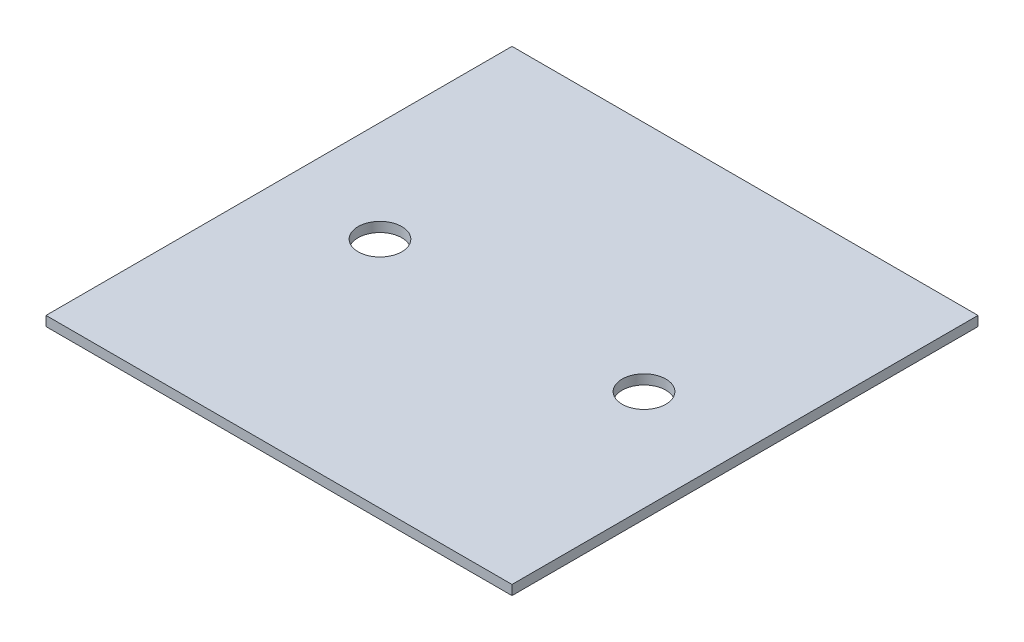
ISO-10303-21;
HEADER;
FILE_DESCRIPTION(('STEP AP214'),'2;1');
FILE_NAME('part.step','',(''),(''),'','','');
FILE_SCHEMA(('AUTOMOTIVE_DESIGN { 1 0 10303 214 1 1 1 1 }'));
ENDSEC;
DATA;
#1=APPLICATION_CONTEXT('core data for automotive mechanical design processes');
#2=APPLICATION_PROTOCOL_DEFINITION('international standard','automotive_design',2000,#1);
#3=PRODUCT_CONTEXT('',#1,'mechanical');
#4=PRODUCT('Part','Part','',(#3));
#5=PRODUCT_RELATED_PRODUCT_CATEGORY('part','',(#4));
#6=PRODUCT_DEFINITION_FORMATION('','',#4);
#7=PRODUCT_DEFINITION_CONTEXT('part definition',#1,'design');
#8=PRODUCT_DEFINITION('design','',#6,#7);
#9=PRODUCT_DEFINITION_SHAPE('','',#8);
#10=(LENGTH_UNIT() NAMED_UNIT(*) SI_UNIT(.MILLI.,.METRE.));
#11=(NAMED_UNIT(*) PLANE_ANGLE_UNIT() SI_UNIT($,.RADIAN.));
#12=(NAMED_UNIT(*) SI_UNIT($,.STERADIAN.) SOLID_ANGLE_UNIT());
#13=UNCERTAINTY_MEASURE_WITH_UNIT(LENGTH_MEASURE(1.E-05),#10,'distance_accuracy_value','');
#14=(GEOMETRIC_REPRESENTATION_CONTEXT(3) GLOBAL_UNCERTAINTY_ASSIGNED_CONTEXT((#13)) GLOBAL_UNIT_ASSIGNED_CONTEXT((#10,
#11,#12)) REPRESENTATION_CONTEXT('',''));
#15=CARTESIAN_POINT('',(0.,0.,0.));
#16=DIRECTION('',(0.,0.,1.));
#17=DIRECTION('',(1.,0.,0.));
#18=AXIS2_PLACEMENT_3D('',#15,#16,#17);
#19=CARTESIAN_POINT('',(-76.2,3.175,-76.2));
#20=DIRECTION('',(1.,0.,0.));
#21=DIRECTION('',(0.,0.,-1.));
#22=AXIS2_PLACEMENT_3D('',#19,#20,#21);
#23=PLANE('',#22);
#24=DIRECTION('',(0.,0.,1.));
#25=VECTOR('',#24,1.);
#26=CARTESIAN_POINT('',(-76.2,0.,-76.2));
#27=LINE('',#26,#25);
#28=CARTESIAN_POINT('',(-76.2,0.,-76.2));
#29=VERTEX_POINT('',#28);
#30=CARTESIAN_POINT('',(-76.2,0.,76.2));
#31=VERTEX_POINT('',#30);
#32=EDGE_CURVE('E96',#29,#31,#27,.T.);
#33=ORIENTED_EDGE('',*,*,#32,.T.);
#34=DIRECTION('',(0.,-1.,0.));
#35=VECTOR('',#34,1.);
#36=CARTESIAN_POINT('',(-76.2,3.175,76.2));
#37=LINE('',#36,#35);
#38=CARTESIAN_POINT('',(-76.2,3.175,76.2));
#39=VERTEX_POINT('',#38);
#40=EDGE_CURVE('E11',#39,#31,#37,.T.);
#41=ORIENTED_EDGE('',*,*,#40,.F.);
#42=DIRECTION('',(0.,0.,1.));
#43=VECTOR('',#42,1.);
#44=CARTESIAN_POINT('',(-76.2,3.175,-76.2));
#45=LINE('',#44,#43);
#46=CARTESIAN_POINT('',(-76.2,3.175,-76.2));
#47=VERTEX_POINT('',#46);
#48=EDGE_CURVE('E84',#47,#39,#45,.T.);
#49=ORIENTED_EDGE('',*,*,#48,.F.);
#50=DIRECTION('',(0.,-1.,0.));
#51=VECTOR('',#50,1.);
#52=CARTESIAN_POINT('',(-76.2,3.175,-76.2));
#53=LINE('',#52,#51);
#54=EDGE_CURVE('E92',#47,#29,#53,.T.);
#55=ORIENTED_EDGE('',*,*,#54,.T.);
#56=EDGE_LOOP('',(#33,#41,#49,#55));
#57=FACE_BOUND('',#56,.T.);
#58=ADVANCED_FACE('F33',(#57),#23,.F.);
#59=CARTESIAN_POINT('',(-76.2,3.175,76.2));
#60=DIRECTION('',(0.,0.,-1.));
#61=DIRECTION('',(-1.,0.,0.));
#62=AXIS2_PLACEMENT_3D('',#59,#60,#61);
#63=PLANE('',#62);
#64=DIRECTION('',(1.,0.,0.));
#65=VECTOR('',#64,1.);
#66=CARTESIAN_POINT('',(-76.2,0.,76.2));
#67=LINE('',#66,#65);
#68=CARTESIAN_POINT('',(76.2,0.,76.2));
#69=VERTEX_POINT('',#68);
#70=EDGE_CURVE('E88',#31,#69,#67,.T.);
#71=ORIENTED_EDGE('',*,*,#70,.T.);
#72=DIRECTION('',(0.,-1.,0.));
#73=VECTOR('',#72,1.);
#74=CARTESIAN_POINT('',(76.2,3.175,76.2));
#75=LINE('',#74,#73);
#76=CARTESIAN_POINT('',(76.2,3.175,76.2));
#77=VERTEX_POINT('',#76);
#78=EDGE_CURVE('E41',#77,#69,#75,.T.);
#79=ORIENTED_EDGE('',*,*,#78,.F.);
#80=DIRECTION('',(1.,0.,0.));
#81=VECTOR('',#80,1.);
#82=CARTESIAN_POINT('',(-76.2,3.175,76.2));
#83=LINE('',#82,#81);
#84=EDGE_CURVE('E79',#39,#77,#83,.T.);
#85=ORIENTED_EDGE('',*,*,#84,.F.);
#86=ORIENTED_EDGE('',*,*,#40,.T.);
#87=EDGE_LOOP('',(#71,#79,#85,#86));
#88=FACE_BOUND('',#87,.T.);
#89=ADVANCED_FACE('F87',(#88),#63,.F.);
#90=CARTESIAN_POINT('',(76.2,3.175,-76.2));
#91=DIRECTION('',(-1.,0.,0.));
#92=DIRECTION('',(0.,0.,1.));
#93=AXIS2_PLACEMENT_3D('',#90,#91,#92);
#94=PLANE('',#93);
#95=DIRECTION('',(0.,0.,-1.));
#96=VECTOR('',#95,1.);
#97=CARTESIAN_POINT('',(76.2,0.,-76.2));
#98=LINE('',#97,#96);
#99=CARTESIAN_POINT('',(76.2,0.,-76.2));
#100=VERTEX_POINT('',#99);
#101=EDGE_CURVE('E66',#69,#100,#98,.T.);
#102=ORIENTED_EDGE('',*,*,#101,.T.);
#103=DIRECTION('',(0.,-1.,0.));
#104=VECTOR('',#103,1.);
#105=CARTESIAN_POINT('',(76.2,3.175,-76.2));
#106=LINE('',#105,#104);
#107=CARTESIAN_POINT('',(76.2,3.175,-76.2));
#108=VERTEX_POINT('',#107);
#109=EDGE_CURVE('E89',#108,#100,#106,.T.);
#110=ORIENTED_EDGE('',*,*,#109,.F.);
#111=DIRECTION('',(0.,0.,-1.));
#112=VECTOR('',#111,1.);
#113=CARTESIAN_POINT('',(76.2,3.175,-76.2));
#114=LINE('',#113,#112);
#115=EDGE_CURVE('E82',#77,#108,#114,.T.);
#116=ORIENTED_EDGE('',*,*,#115,.F.);
#117=ORIENTED_EDGE('',*,*,#78,.T.);
#118=EDGE_LOOP('',(#102,#110,#116,#117));
#119=FACE_BOUND('',#118,.T.);
#120=ADVANCED_FACE('F90',(#119),#94,.F.);
#121=CARTESIAN_POINT('',(-76.2,3.175,-76.2));
#122=DIRECTION('',(0.,0.,1.));
#123=DIRECTION('',(1.,0.,0.));
#124=AXIS2_PLACEMENT_3D('',#121,#122,#123);
#125=PLANE('',#124);
#126=DIRECTION('',(-1.,0.,0.));
#127=VECTOR('',#126,1.);
#128=CARTESIAN_POINT('',(-76.2,0.,-76.2));
#129=LINE('',#128,#127);
#130=EDGE_CURVE('E72',#100,#29,#129,.T.);
#131=ORIENTED_EDGE('',*,*,#130,.T.);
#132=ORIENTED_EDGE('',*,*,#54,.F.);
#133=DIRECTION('',(-1.,0.,0.));
#134=VECTOR('',#133,1.);
#135=CARTESIAN_POINT('',(-76.2,3.175,-76.2));
#136=LINE('',#135,#134);
#137=EDGE_CURVE('E49',#108,#47,#136,.T.);
#138=ORIENTED_EDGE('',*,*,#137,.F.);
#139=ORIENTED_EDGE('',*,*,#109,.T.);
#140=EDGE_LOOP('',(#131,#132,#138,#139));
#141=FACE_BOUND('',#140,.T.);
#142=ADVANCED_FACE('F104',(#141),#125,.F.);
#143=CARTESIAN_POINT('',(0.,3.175,0.));
#144=DIRECTION('',(0.,1.,0.));
#145=DIRECTION('',(0.,0.,1.));
#146=AXIS2_PLACEMENT_3D('',#143,#144,#145);
#147=PLANE('',#146);
#148=CARTESIAN_POINT('',(-43.18,3.175,0.));
#149=DIRECTION('',(0.,1.,0.));
#150=DIRECTION('',(0.,0.,1.));
#151=AXIS2_PLACEMENT_3D('',#148,#149,#150);
#152=CIRCLE('',#151,7.14375);
#153=CARTESIAN_POINT('',(-43.18,3.175,7.14375));
#154=VERTEX_POINT('',#153);
#155=EDGE_CURVE('E99',#154,#154,#152,.F.);
#156=ORIENTED_EDGE('',*,*,#155,.T.);
#157=EDGE_LOOP('',(#156));
#158=FACE_BOUND('',#157,.T.);
#159=CARTESIAN_POINT('',(43.18,3.175,0.));
#160=DIRECTION('',(0.,1.,0.));
#161=DIRECTION('',(0.,0.,1.));
#162=AXIS2_PLACEMENT_3D('',#159,#160,#161);
#163=CIRCLE('',#162,7.14375);
#164=CARTESIAN_POINT('',(43.18,3.175,7.14375));
#165=VERTEX_POINT('',#164);
#166=EDGE_CURVE('E112',#165,#165,#163,.F.);
#167=ORIENTED_EDGE('',*,*,#166,.T.);
#168=EDGE_LOOP('',(#167));
#169=FACE_BOUND('',#168,.T.);
#170=ORIENTED_EDGE('',*,*,#48,.T.);
#171=ORIENTED_EDGE('',*,*,#84,.T.);
#172=ORIENTED_EDGE('',*,*,#115,.T.);
#173=ORIENTED_EDGE('',*,*,#137,.T.);
#174=EDGE_LOOP('',(#170,#171,#172,#173));
#175=FACE_BOUND('',#174,.T.);
#176=ADVANCED_FACE('F80',(#158,#169,#175),#147,.T.);
#177=CARTESIAN_POINT('',(0.,0.,0.));
#178=DIRECTION('',(0.,1.,0.));
#179=DIRECTION('',(0.,0.,1.));
#180=AXIS2_PLACEMENT_3D('',#177,#178,#179);
#181=PLANE('',#180);
#182=CARTESIAN_POINT('',(-43.18,0.,0.));
#183=DIRECTION('',(0.,1.,0.));
#184=DIRECTION('',(0.,0.,1.));
#185=AXIS2_PLACEMENT_3D('',#182,#183,#184);
#186=CIRCLE('',#185,7.14375);
#187=CARTESIAN_POINT('',(-43.18,0.,7.14375));
#188=VERTEX_POINT('',#187);
#189=EDGE_CURVE('E115',#188,#188,#186,.T.);
#190=ORIENTED_EDGE('',*,*,#189,.T.);
#191=EDGE_LOOP('',(#190));
#192=FACE_BOUND('',#191,.T.);
#193=CARTESIAN_POINT('',(43.18,0.,0.));
#194=DIRECTION('',(0.,1.,0.));
#195=DIRECTION('',(0.,0.,1.));
#196=AXIS2_PLACEMENT_3D('',#193,#194,#195);
#197=CIRCLE('',#196,7.14375);
#198=CARTESIAN_POINT('',(43.18,0.,7.14375));
#199=VERTEX_POINT('',#198);
#200=EDGE_CURVE('E116',#199,#199,#197,.T.);
#201=ORIENTED_EDGE('',*,*,#200,.T.);
#202=EDGE_LOOP('',(#201));
#203=FACE_BOUND('',#202,.T.);
#204=ORIENTED_EDGE('',*,*,#32,.F.);
#205=ORIENTED_EDGE('',*,*,#130,.F.);
#206=ORIENTED_EDGE('',*,*,#101,.F.);
#207=ORIENTED_EDGE('',*,*,#70,.F.);
#208=EDGE_LOOP('',(#204,#205,#206,#207));
#209=FACE_BOUND('',#208,.T.);
#210=ADVANCED_FACE('F107',(#192,#203,#209),#181,.F.);
#211=CARTESIAN_POINT('',(43.18,25.4,0.));
#212=DIRECTION('',(0.,-1.,0.));
#213=DIRECTION('',(0.,0.,-1.));
#214=AXIS2_PLACEMENT_3D('',#211,#212,#213);
#215=CYLINDRICAL_SURFACE('',#214,7.14375);
#216=ORIENTED_EDGE('',*,*,#166,.F.);
#217=EDGE_LOOP('',(#216));
#218=FACE_BOUND('',#217,.T.);
#219=ORIENTED_EDGE('',*,*,#200,.F.);
#220=EDGE_LOOP('',(#219));
#221=FACE_BOUND('',#220,.T.);
#222=ADVANCED_FACE('F126',(#218,#221),#215,.F.);
#223=CARTESIAN_POINT('',(-43.18,25.4,0.));
#224=DIRECTION('',(0.,-1.,0.));
#225=DIRECTION('',(0.,0.,-1.));
#226=AXIS2_PLACEMENT_3D('',#223,#224,#225);
#227=CYLINDRICAL_SURFACE('',#226,7.14375);
#228=ORIENTED_EDGE('',*,*,#155,.F.);
#229=EDGE_LOOP('',(#228));
#230=FACE_BOUND('',#229,.T.);
#231=ORIENTED_EDGE('',*,*,#189,.F.);
#232=EDGE_LOOP('',(#231));
#233=FACE_BOUND('',#232,.T.);
#234=ADVANCED_FACE('F124',(#230,#233),#227,.F.);
#235=CLOSED_SHELL('',(#58,#89,#120,#142,#176,#210,#222,#234));
#236=MANIFOLD_SOLID_BREP('B2',#235);
#237=ADVANCED_BREP_SHAPE_REPRESENTATION('',(#18,#236),#14);
#238=SHAPE_DEFINITION_REPRESENTATION(#9,#237);
ENDSEC;
END-ISO-10303-21;
